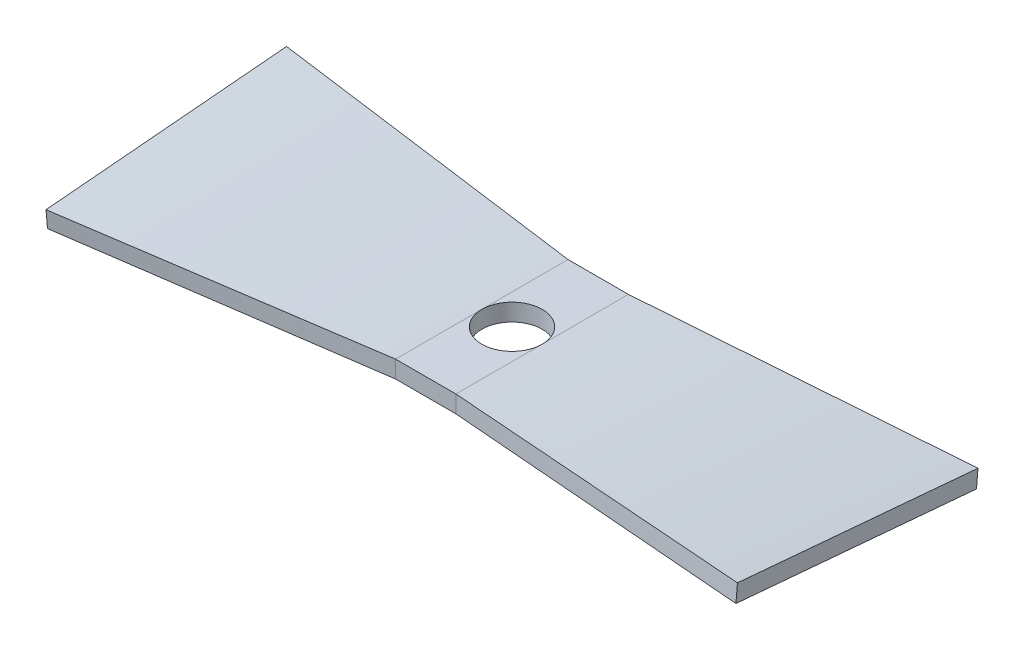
from build123d import *

# Parameters (mm, degrees)
SKETCH1_W          = 3.5
SKETCH1_H          = 10
EXTRUDE3_DEPTH     = 0.5
SKETCH10_R         = 1.75
CUT_EXTRUDE1_DEPTH = 1


with BuildPart() as part:
    # Sketch1 → Extrude3 (new, symmetric)
    with BuildSketch(Plane(origin=(0, 0, 0), x_dir=(1, 0, 0), z_dir=(0, 1, 0))):
        Rectangle(SKETCH1_W, SKETCH1_H)
    extrude(amount=EXTRUDE3_DEPTH, both=True)

    # Sketch6 → Loft4 section 0
    with BuildSketch(Plane.ZY.offset(-20)):
        with BuildLine():
            Line((-6.929785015, -1.108187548), (7.016940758, 0.11199285))
            Line((7.016940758, 0.11199285), (6.929785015, 1.108187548))
            Line((6.929785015, 1.108187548), (-7.016940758, -0.11199285))
            Line((-7.016940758, -0.11199285), (-6.929785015, -1.108187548))
        make_face()
    # Sketch8 → Loft4 section 1
    with BuildSketch(Plane(origin=(1.75, 0, 0), x_dir=(0, 0, -1), z_dir=(1, 0, 0))):
        with BuildLine():
            Line((-5, 0.5), (5, 0.5))
            Line((5, 0.5), (5, -0.5))
            Line((5, -0.5), (-5, -0.5))
            Line((-5, -0.5), (-5, 0.5))
        make_face()
    loft()

    # Sketch7 → Loft5 section 0
    with BuildSketch(Plane.ZY.offset(20)):
        with BuildLine():
            Line((7.016940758, -0.11199285), (-6.929785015, 1.108187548))
            Line((-6.929785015, 1.108187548), (-7.016940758, 0.11199285))
            Line((-7.016940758, 0.11199285), (6.929785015, -1.108187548))
            Line((6.929785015, -1.108187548), (7.016940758, -0.11199285))
        make_face()
    # Sketch9 → Loft5 section 1
    with BuildSketch(Plane.ZY.offset(1.75)):
        with BuildLine():
            Line((-5, 0.5), (5, 0.5))
            Line((5, 0.5), (5, -0.5))
            Line((5, -0.5), (-5, -0.5))
            Line((-5, -0.5), (-5, 0.5))
        make_face()
    loft()

    # Sketch10 → Cut-Extrude1 (cut)
    with BuildSketch(Plane(origin=(0, 0.5, 0), x_dir=(-1, 0, 0), z_dir=(0, 1, 0))):
        with Locations(Location((0, 0, 0), (0, 0, 180))):
            Circle(SKETCH10_R)
    extrude(amount=-CUT_EXTRUDE1_DEPTH, mode=Mode.SUBTRACT)


solid = part.part
